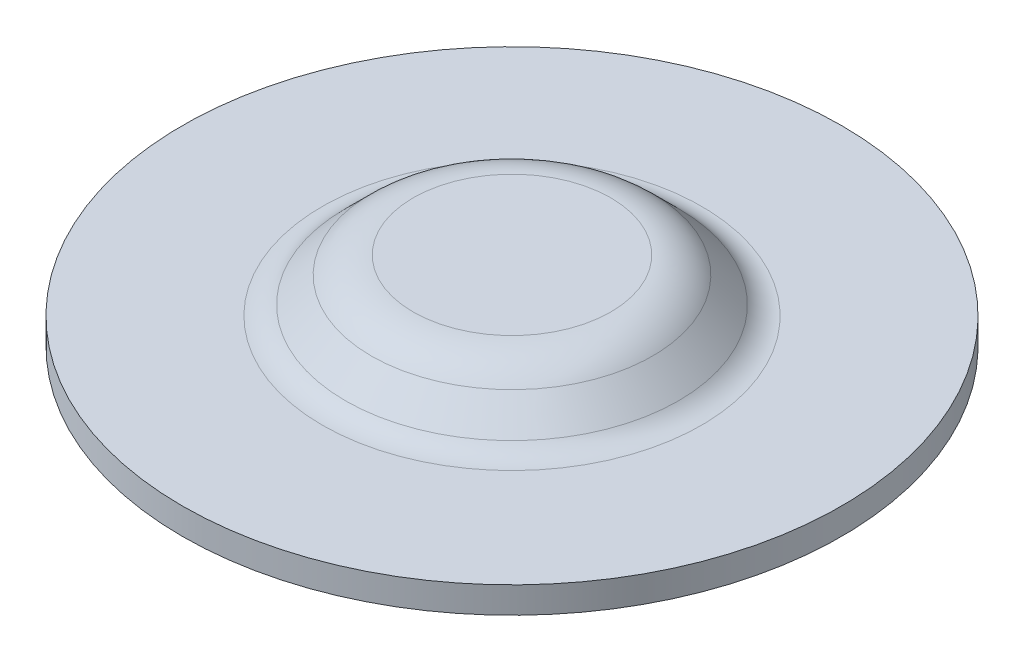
ISO-10303-21;
HEADER;
FILE_DESCRIPTION(('STEP AP214'),'2;1');
FILE_NAME('part.step','',(''),(''),'','','');
FILE_SCHEMA(('AUTOMOTIVE_DESIGN { 1 0 10303 214 1 1 1 1 }'));
ENDSEC;
DATA;
#1=APPLICATION_CONTEXT('core data for automotive mechanical design processes');
#2=APPLICATION_PROTOCOL_DEFINITION('international standard','automotive_design',2000,#1);
#3=PRODUCT_CONTEXT('',#1,'mechanical');
#4=PRODUCT('Part','Part','',(#3));
#5=PRODUCT_RELATED_PRODUCT_CATEGORY('part','',(#4));
#6=PRODUCT_DEFINITION_FORMATION('','',#4);
#7=PRODUCT_DEFINITION_CONTEXT('part definition',#1,'design');
#8=PRODUCT_DEFINITION('design','',#6,#7);
#9=PRODUCT_DEFINITION_SHAPE('','',#8);
#10=(LENGTH_UNIT() NAMED_UNIT(*) SI_UNIT(.MILLI.,.METRE.));
#11=(NAMED_UNIT(*) PLANE_ANGLE_UNIT() SI_UNIT($,.RADIAN.));
#12=(NAMED_UNIT(*) SI_UNIT($,.STERADIAN.) SOLID_ANGLE_UNIT());
#13=UNCERTAINTY_MEASURE_WITH_UNIT(LENGTH_MEASURE(1.E-05),#10,'distance_accuracy_value','');
#14=(GEOMETRIC_REPRESENTATION_CONTEXT(3) GLOBAL_UNCERTAINTY_ASSIGNED_CONTEXT((#13)) GLOBAL_UNIT_ASSIGNED_CONTEXT((#10,
#11,#12)) REPRESENTATION_CONTEXT('',''));
#15=CARTESIAN_POINT('',(0.,0.,0.));
#16=DIRECTION('',(0.,0.,1.));
#17=DIRECTION('',(1.,0.,0.));
#18=AXIS2_PLACEMENT_3D('',#15,#16,#17);
#19=CARTESIAN_POINT('',(0.,-1.27,0.));
#20=DIRECTION('',(0.,1.,0.));
#21=DIRECTION('',(0.,0.,1.));
#22=AXIS2_PLACEMENT_3D('',#19,#20,#21);
#23=PLANE('',#22);
#24=CARTESIAN_POINT('',(0.,-1.27,4.7625));
#25=CARTESIAN_POINT('',(0.907881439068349,-1.27,4.7625));
#26=CARTESIAN_POINT('',(1.75305105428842,-1.27,4.42811678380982));
#27=CARTESIAN_POINT('',(2.20104177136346,-1.27,4.25087357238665));
#28=CARTESIAN_POINT('',(2.60608645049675,-1.27,3.98619112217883));
#29=CARTESIAN_POINT('',(3.01804587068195,-1.27,3.71699013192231));
#30=CARTESIAN_POINT('',(3.36759604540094,-1.27,3.36759604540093));
#31=CARTESIAN_POINT('',(3.71565053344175,-1.27,3.01969697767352));
#32=CARTESIAN_POINT('',(3.98619112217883,-1.27,2.60608645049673));
#33=CARTESIAN_POINT('',(4.2499126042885,-1.27,2.20290117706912));
#34=CARTESIAN_POINT('',(4.42811678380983,-1.27,1.75305105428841));
#35=CARTESIAN_POINT('',(4.76230037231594,-1.27,0.909453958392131));
#36=CARTESIAN_POINT('',(4.7625,-1.27,0.));
#37=CARTESIAN_POINT('',(4.76269917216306,-1.27,-0.907378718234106));
#38=CARTESIAN_POINT('',(4.42811678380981,-1.27,-1.75305105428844));
#39=CARTESIAN_POINT('',(4.25087320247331,-1.27,-2.20104233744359));
#40=CARTESIAN_POINT('',(3.98619112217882,-1.27,-2.60608645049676));
#41=CARTESIAN_POINT('',(3.71699013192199,-1.27,-3.01804587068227));
#42=CARTESIAN_POINT('',(3.36759604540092,-1.27,-3.36759604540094));
#43=CARTESIAN_POINT('',(3.01969697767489,-1.27,-3.71565053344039));
#44=CARTESIAN_POINT('',(2.60608645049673,-1.27,-3.98619112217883));
#45=CARTESIAN_POINT('',(2.20290117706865,-1.27,-4.24991260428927));
#46=CARTESIAN_POINT('',(1.75305105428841,-1.27,-4.42811678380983));
#47=CARTESIAN_POINT('',(0.908950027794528,-1.27,-4.7625));
#48=CARTESIAN_POINT('',(0.,-1.27,-4.7625));
#49=B_SPLINE_CURVE_WITH_KNOTS('',2,(#24,#25,#26,#27,#28,#29,#30,#31,#32,#33,#34,#35,#36,#37,#38,
#39,#40,#41,#42,#43,#44,#45,#46,#47,#48),.UNSPECIFIED.,.F.,.F.,(3,2,2,2,2,2,2,2,2,2,2,2,3),(0.,
0.125,0.1875,0.25,0.3125,0.375,0.5,0.625,0.6875,0.75,0.8125,0.875,1.),.UNSPECIFIED.);
#50=CARTESIAN_POINT('',(0.,-1.27,-4.7625));
#51=VERTEX_POINT('',#50);
#52=CARTESIAN_POINT('',(0.,-1.27,4.7625));
#53=VERTEX_POINT('',#52);
#54=EDGE_CURVE('E34',#51,#53,#49,.F.);
#55=ORIENTED_EDGE('',*,*,#54,.T.);
#56=CARTESIAN_POINT('',(0.,-1.27,-4.7625));
#57=CARTESIAN_POINT('',(-0.907881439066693,-1.27,-4.7625));
#58=CARTESIAN_POINT('',(-1.75305105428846,-1.27,-4.42811678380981));
#59=CARTESIAN_POINT('',(-2.20104177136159,-1.27,-4.25087357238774));
#60=CARTESIAN_POINT('',(-2.60608645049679,-1.27,-3.9861911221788));
#61=CARTESIAN_POINT('',(-3.01804587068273,-1.27,-3.71699013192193));
#62=CARTESIAN_POINT('',(-3.36759604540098,-1.27,-3.36759604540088));
#63=CARTESIAN_POINT('',(-3.7156505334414,-1.27,-3.01969697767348));
#64=CARTESIAN_POINT('',(-3.98619112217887,-1.27,-2.60608645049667));
#65=CARTESIAN_POINT('',(-4.24991260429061,-1.27,-2.20290117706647));
#66=CARTESIAN_POINT('',(-4.42811678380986,-1.27,-1.75305105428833));
#67=CARTESIAN_POINT('',(-4.76230037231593,-1.27,-0.909453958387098));
#68=CARTESIAN_POINT('',(-4.7625,-1.27,0.));
#69=CARTESIAN_POINT('',(-4.76269917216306,-1.27,0.907378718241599));
#70=CARTESIAN_POINT('',(-4.4281167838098,-1.27,1.75305105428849));
#71=CARTESIAN_POINT('',(-4.2508732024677,-1.27,2.20104233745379));
#72=CARTESIAN_POINT('',(-3.98619112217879,-1.27,2.60608645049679));
#73=CARTESIAN_POINT('',(-3.71699013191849,-1.27,3.01804587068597));
#74=CARTESIAN_POINT('',(-3.3675960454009,-1.27,3.36759604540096));
#75=CARTESIAN_POINT('',(-3.01969697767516,-1.27,3.71565053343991));
#76=CARTESIAN_POINT('',(-2.60608645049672,-1.27,3.98619112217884));
#77=CARTESIAN_POINT('',(-2.20290117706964,-1.27,4.24991260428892));
#78=CARTESIAN_POINT('',(-1.75305105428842,-1.27,4.42811678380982));
#79=CARTESIAN_POINT('',(-0.908950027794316,-1.27,4.7625));
#80=CARTESIAN_POINT('',(0.,-1.27,4.7625));
#81=B_SPLINE_CURVE_WITH_KNOTS('',2,(#56,#57,#58,#59,#60,#61,#62,#63,#64,#65,#66,#67,#68,#69,#70,
#71,#72,#73,#74,#75,#76,#77,#78,#79,#80),.UNSPECIFIED.,.F.,.F.,(3,2,2,2,2,2,2,2,2,2,2,2,3),(0.,
0.125,0.1875,0.25,0.3125,0.375,0.5,0.625,0.6875,0.75,0.8125,0.875,1.),.UNSPECIFIED.);
#82=EDGE_CURVE('E37',#53,#51,#81,.F.);
#83=ORIENTED_EDGE('',*,*,#82,.T.);
#84=EDGE_LOOP('',(#55,#83));
#85=FACE_BOUND('',#84,.T.);
#86=ADVANCED_FACE('F18',(#85),#23,.F.);
#87=CARTESIAN_POINT('',(0.,-2.84480000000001,0.));
#88=DIRECTION('',(0.,1.,0.));
#89=DIRECTION('',(0.,0.,1.));
#90=AXIS2_PLACEMENT_3D('',#87,#88,#89);
#91=TOROIDAL_SURFACE('',#90,4.7625,1.5748);
#92=ORIENTED_EDGE('',*,*,#82,.F.);
#93=ORIENTED_EDGE('',*,*,#54,.F.);
#94=EDGE_LOOP('',(#92,#93));
#95=FACE_BOUND('',#94,.T.);
#96=CARTESIAN_POINT('',(0.,-1.7312482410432,0.));
#97=DIRECTION('',(0.,-1.,0.));
#98=DIRECTION('',(0.,0.,-1.));
#99=AXIS2_PLACEMENT_3D('',#96,#97,#98);
#100=CIRCLE('',#99,5.87605175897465);
#101=CARTESIAN_POINT('',(0.,-1.7312482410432,-5.87605175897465));
#102=VERTEX_POINT('',#101);
#103=EDGE_CURVE('E41',#102,#102,#100,.T.);
#104=ORIENTED_EDGE('',*,*,#103,.T.);
#105=EDGE_LOOP('',(#104));
#106=FACE_BOUND('',#105,.T.);
#107=ADVANCED_FACE('F39',(#95,#106),#91,.F.);
#108=CARTESIAN_POINT('',(0.,0.,0.));
#109=DIRECTION('',(0.,-1.,0.));
#110=DIRECTION('',(0.,0.,-1.));
#111=AXIS2_PLACEMENT_3D('',#108,#109,#110);
#112=PLANE('',#111);
#113=CARTESIAN_POINT('',(0.,0.,0.));
#114=DIRECTION('',(0.,1.,0.));
#115=DIRECTION('',(0.,0.,1.));
#116=AXIS2_PLACEMENT_3D('',#113,#114,#115);
#117=CIRCLE('',#116,4.7625);
#118=CARTESIAN_POINT('',(0.,0.,4.7625));
#119=VERTEX_POINT('',#118);
#120=EDGE_CURVE('E22',#119,#119,#117,.F.);
#121=ORIENTED_EDGE('',*,*,#120,.F.);
#122=EDGE_LOOP('',(#121));
#123=FACE_BOUND('',#122,.T.);
#124=ADVANCED_FACE('F58',(#123),#112,.F.);
#125=CARTESIAN_POINT('',(0.,-2.97677737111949,0.));
#126=DIRECTION('',(0.,-1.,0.));
#127=DIRECTION('',(0.,0.,-1.));
#128=AXIS2_PLACEMENT_3D('',#125,#126,#127);
#129=CONICAL_SURFACE('',#128,7.12158088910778,0.785398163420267);
#130=CARTESIAN_POINT('',(0.,-2.97677737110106,0.));
#131=DIRECTION('',(0.,1.,0.));
#132=DIRECTION('',(0.,0.,-1.));
#133=AXIS2_PLACEMENT_3D('',#130,#131,#132);
#134=CIRCLE('',#133,7.12158088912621);
#135=CARTESIAN_POINT('',(0.,-2.97677737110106,-7.12158088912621));
#136=VERTEX_POINT('',#135);
#137=EDGE_CURVE('E103',#136,#136,#134,.T.);
#138=ORIENTED_EDGE('',*,*,#137,.F.);
#139=EDGE_LOOP('',(#138));
#140=FACE_BOUND('',#139,.T.);
#141=ORIENTED_EDGE('',*,*,#103,.F.);
#142=EDGE_LOOP('',(#141));
#143=FACE_BOUND('',#142,.T.);
#144=ADVANCED_FACE('F66',(#140,#143),#129,.F.);
#145=CARTESIAN_POINT('',(0.,-2.84480000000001,0.));
#146=DIRECTION('',(0.,1.,0.));
#147=DIRECTION('',(0.,0.,1.));
#148=AXIS2_PLACEMENT_3D('',#145,#146,#147);
#149=TOROIDAL_SURFACE('',#148,4.7625,2.84480000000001);
#150=CARTESIAN_POINT('',(0.,-0.833222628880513,0.));
#151=DIRECTION('',(0.,-1.,0.));
#152=DIRECTION('',(0.,0.,-1.));
#153=AXIS2_PLACEMENT_3D('',#150,#151,#152);
#154=CIRCLE('',#153,6.77407737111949);
#155=CARTESIAN_POINT('',(0.,-0.833222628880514,-6.77407737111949));
#156=VERTEX_POINT('',#155);
#157=EDGE_CURVE('E105',#156,#156,#154,.T.);
#158=ORIENTED_EDGE('',*,*,#157,.F.);
#159=EDGE_LOOP('',(#158));
#160=FACE_BOUND('',#159,.T.);
#161=ORIENTED_EDGE('',*,*,#120,.T.);
#162=EDGE_LOOP('',(#161));
#163=FACE_BOUND('',#162,.T.);
#164=ADVANCED_FACE('F63',(#160,#163),#149,.T.);
#165=CARTESIAN_POINT('',(0.,-0.965200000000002,0.));
#166=DIRECTION('',(0.,1.,0.));
#167=DIRECTION('',(0.,0.,1.));
#168=AXIS2_PLACEMENT_3D('',#165,#166,#167);
#169=TOROIDAL_SURFACE('',#168,9.13315826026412,2.8448);
#170=ORIENTED_EDGE('',*,*,#137,.T.);
#171=EDGE_LOOP('',(#170));
#172=FACE_BOUND('',#171,.T.);
#173=CARTESIAN_POINT('',(0.,-3.81,0.));
#174=DIRECTION('',(0.,1.,0.));
#175=DIRECTION('',(0.,0.,1.));
#176=AXIS2_PLACEMENT_3D('',#173,#174,#175);
#177=CIRCLE('',#176,9.13315826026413);
#178=CARTESIAN_POINT('',(0.,-3.81,9.13315826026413));
#179=VERTEX_POINT('',#178);
#180=EDGE_CURVE('E108',#179,#179,#177,.F.);
#181=ORIENTED_EDGE('',*,*,#180,.T.);
#182=EDGE_LOOP('',(#181));
#183=FACE_BOUND('',#182,.T.);
#184=ADVANCED_FACE('F65',(#172,#183),#169,.T.);
#185=CARTESIAN_POINT('',(0.,-2.07875175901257,0.));
#186=DIRECTION('',(0.,-1.,0.));
#187=DIRECTION('',(0.,0.,-1.));
#188=AXIS2_PLACEMENT_3D('',#185,#186,#187);
#189=CONICAL_SURFACE('',#188,8.01960650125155,0.785398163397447);
#190=ORIENTED_EDGE('',*,*,#157,.T.);
#191=EDGE_LOOP('',(#190));
#192=FACE_BOUND('',#191,.T.);
#193=CARTESIAN_POINT('',(0.,-2.07875175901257,0.));
#194=DIRECTION('',(0.,1.,0.));
#195=DIRECTION('',(0.,0.,-1.));
#196=AXIS2_PLACEMENT_3D('',#193,#194,#195);
#197=CIRCLE('',#196,8.01960650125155);
#198=CARTESIAN_POINT('',(0.,-2.07875175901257,-8.01960650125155));
#199=VERTEX_POINT('',#198);
#200=EDGE_CURVE('E112',#199,#199,#197,.T.);
#201=ORIENTED_EDGE('',*,*,#200,.T.);
#202=EDGE_LOOP('',(#201));
#203=FACE_BOUND('',#202,.T.);
#204=ADVANCED_FACE('F69',(#192,#203),#189,.T.);
#205=CARTESIAN_POINT('',(9.13315826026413,-3.81,0.));
#206=DIRECTION('',(0.,1.,0.));
#207=DIRECTION('',(0.,0.,1.));
#208=AXIS2_PLACEMENT_3D('',#205,#206,#207);
#209=PLANE('',#208);
#210=CARTESIAN_POINT('',(0.,-3.81,0.));
#211=DIRECTION('',(0.,1.,0.));
#212=DIRECTION('',(0.,0.,1.));
#213=AXIS2_PLACEMENT_3D('',#210,#211,#212);
#214=CIRCLE('',#213,15.875);
#215=CARTESIAN_POINT('',(0.,-3.81,15.875));
#216=VERTEX_POINT('',#215);
#217=EDGE_CURVE('E114',#216,#216,#214,.T.);
#218=ORIENTED_EDGE('',*,*,#217,.F.);
#219=EDGE_LOOP('',(#218));
#220=FACE_BOUND('',#219,.T.);
#221=ORIENTED_EDGE('',*,*,#180,.F.);
#222=EDGE_LOOP('',(#221));
#223=FACE_BOUND('',#222,.T.);
#224=ADVANCED_FACE('F75',(#220,#223),#209,.F.);
#225=CARTESIAN_POINT('',(0.,-0.965200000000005,0.));
#226=DIRECTION('',(0.,1.,0.));
#227=DIRECTION('',(0.,0.,1.));
#228=AXIS2_PLACEMENT_3D('',#225,#226,#227);
#229=TOROIDAL_SURFACE('',#228,9.13315826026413,1.5748);
#230=CARTESIAN_POINT('',(0.,-2.54,0.));
#231=DIRECTION('',(0.,1.,0.));
#232=DIRECTION('',(0.,0.,1.));
#233=AXIS2_PLACEMENT_3D('',#230,#231,#232);
#234=CIRCLE('',#233,9.13315826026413);
#235=CARTESIAN_POINT('',(0.,-2.54,9.13315826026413));
#236=VERTEX_POINT('',#235);
#237=EDGE_CURVE('E28',#236,#236,#234,.T.);
#238=ORIENTED_EDGE('',*,*,#237,.T.);
#239=EDGE_LOOP('',(#238));
#240=FACE_BOUND('',#239,.T.);
#241=ORIENTED_EDGE('',*,*,#200,.F.);
#242=EDGE_LOOP('',(#241));
#243=FACE_BOUND('',#242,.T.);
#244=ADVANCED_FACE('F20',(#240,#243),#229,.F.);
#245=CARTESIAN_POINT('',(0.,-3.8112539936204,0.));
#246=DIRECTION('',(0.,1.,0.));
#247=DIRECTION('',(0.,0.,1.));
#248=AXIS2_PLACEMENT_3D('',#245,#246,#247);
#249=CYLINDRICAL_SURFACE('',#248,15.875);
#250=ORIENTED_EDGE('',*,*,#217,.T.);
#251=EDGE_LOOP('',(#250));
#252=FACE_BOUND('',#251,.T.);
#253=CARTESIAN_POINT('',(0.,-2.54,0.));
#254=DIRECTION('',(0.,1.,0.));
#255=DIRECTION('',(0.,0.,1.));
#256=AXIS2_PLACEMENT_3D('',#253,#254,#255);
#257=CIRCLE('',#256,15.875);
#258=CARTESIAN_POINT('',(0.,-2.54,15.875));
#259=VERTEX_POINT('',#258);
#260=EDGE_CURVE('E11',#259,#259,#257,.F.);
#261=ORIENTED_EDGE('',*,*,#260,.T.);
#262=EDGE_LOOP('',(#261));
#263=FACE_BOUND('',#262,.T.);
#264=ADVANCED_FACE('F82',(#252,#263),#249,.T.);
#265=CARTESIAN_POINT('',(9.13315826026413,-2.54,0.));
#266=DIRECTION('',(0.,-1.,0.));
#267=DIRECTION('',(0.,0.,-1.));
#268=AXIS2_PLACEMENT_3D('',#265,#266,#267);
#269=PLANE('',#268);
#270=ORIENTED_EDGE('',*,*,#260,.F.);
#271=EDGE_LOOP('',(#270));
#272=FACE_BOUND('',#271,.T.);
#273=ORIENTED_EDGE('',*,*,#237,.F.);
#274=EDGE_LOOP('',(#273));
#275=FACE_BOUND('',#274,.T.);
#276=ADVANCED_FACE('F80',(#272,#275),#269,.F.);
#277=CLOSED_SHELL('',(#86,#107,#124,#144,#164,#184,#204,#224,#244,#264,#276));
#278=MANIFOLD_SOLID_BREP('B1',#277);
#279=ADVANCED_BREP_SHAPE_REPRESENTATION('',(#18,#278),#14);
#280=SHAPE_DEFINITION_REPRESENTATION(#9,#279);
ENDSEC;
END-ISO-10303-21;
